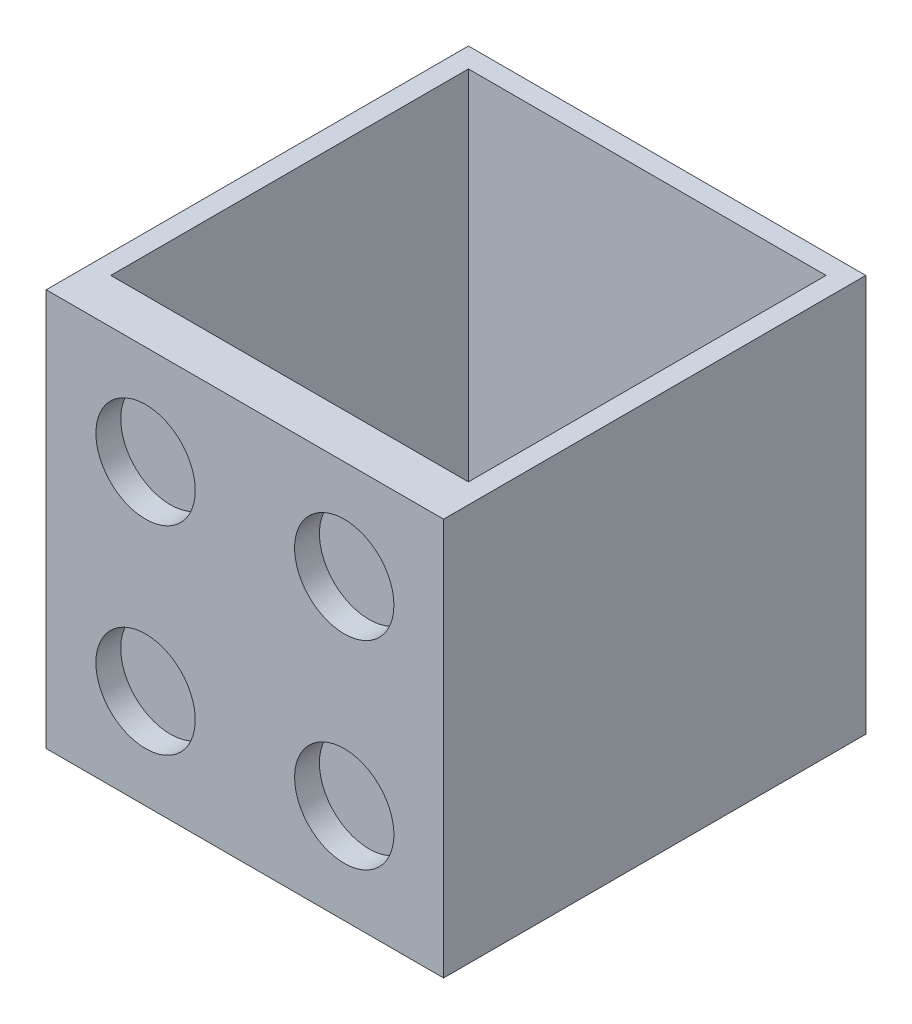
ISO-10303-21;
HEADER;
FILE_DESCRIPTION(('STEP AP214'),'2;1');
FILE_NAME('part.step','',(''),(''),'','','');
FILE_SCHEMA(('AUTOMOTIVE_DESIGN { 1 0 10303 214 1 1 1 1 }'));
ENDSEC;
DATA;
#1=APPLICATION_CONTEXT('core data for automotive mechanical design processes');
#2=APPLICATION_PROTOCOL_DEFINITION('international standard','automotive_design',2000,#1);
#3=PRODUCT_CONTEXT('',#1,'mechanical');
#4=PRODUCT('Part','Part','',(#3));
#5=PRODUCT_RELATED_PRODUCT_CATEGORY('part','',(#4));
#6=PRODUCT_DEFINITION_FORMATION('','',#4);
#7=PRODUCT_DEFINITION_CONTEXT('part definition',#1,'design');
#8=PRODUCT_DEFINITION('design','',#6,#7);
#9=PRODUCT_DEFINITION_SHAPE('','',#8);
#10=(LENGTH_UNIT() NAMED_UNIT(*) SI_UNIT(.MILLI.,.METRE.));
#11=(NAMED_UNIT(*) PLANE_ANGLE_UNIT() SI_UNIT($,.RADIAN.));
#12=(NAMED_UNIT(*) SI_UNIT($,.STERADIAN.) SOLID_ANGLE_UNIT());
#13=UNCERTAINTY_MEASURE_WITH_UNIT(LENGTH_MEASURE(1.E-05),#10,'distance_accuracy_value','');
#14=(GEOMETRIC_REPRESENTATION_CONTEXT(3) GLOBAL_UNCERTAINTY_ASSIGNED_CONTEXT((#13)) GLOBAL_UNIT_ASSIGNED_CONTEXT((#10,
#11,#12)) REPRESENTATION_CONTEXT('',''));
#15=CARTESIAN_POINT('',(0.,0.,0.));
#16=DIRECTION('',(0.,0.,1.));
#17=DIRECTION('',(1.,0.,0.));
#18=AXIS2_PLACEMENT_3D('',#15,#16,#17);
#19=CARTESIAN_POINT('',(0.,0.,53.975));
#20=DIRECTION('',(0.,0.,-1.));
#21=DIRECTION('',(-1.,0.,0.));
#22=AXIS2_PLACEMENT_3D('',#19,#20,#21);
#23=PLANE('',#22);
#24=CARTESIAN_POINT('',(38.1,38.1,53.975));
#25=DIRECTION('',(0.,0.,1.));
#26=DIRECTION('',(1.,0.,0.));
#27=AXIS2_PLACEMENT_3D('',#24,#25,#26);
#28=CIRCLE('',#27,6.35);
#29=CARTESIAN_POINT('',(44.45,38.1,53.975));
#30=VERTEX_POINT('',#29);
#31=EDGE_CURVE('E187',#30,#30,#28,.T.);
#32=ORIENTED_EDGE('',*,*,#31,.F.);
#33=EDGE_LOOP('',(#32));
#34=FACE_BOUND('',#33,.T.);
#35=CARTESIAN_POINT('',(12.7,12.7,53.975));
#36=DIRECTION('',(0.,0.,-1.));
#37=DIRECTION('',(-1.,0.,0.));
#38=AXIS2_PLACEMENT_3D('',#35,#36,#37);
#39=CIRCLE('',#38,6.35);
#40=CARTESIAN_POINT('',(6.35,12.7,53.975));
#41=VERTEX_POINT('',#40);
#42=EDGE_CURVE('E179',#41,#41,#39,.T.);
#43=ORIENTED_EDGE('',*,*,#42,.T.);
#44=EDGE_LOOP('',(#43));
#45=FACE_BOUND('',#44,.T.);
#46=DIRECTION('',(0.,-1.,0.));
#47=VECTOR('',#46,1.);
#48=CARTESIAN_POINT('',(0.,0.,53.975));
#49=LINE('',#48,#47);
#50=CARTESIAN_POINT('',(0.,50.8,53.975));
#51=VERTEX_POINT('',#50);
#52=CARTESIAN_POINT('',(0.,0.,53.975));
#53=VERTEX_POINT('',#52);
#54=EDGE_CURVE('E203',#51,#53,#49,.T.);
#55=ORIENTED_EDGE('',*,*,#54,.T.);
#56=DIRECTION('',(1.,0.,0.));
#57=VECTOR('',#56,1.);
#58=CARTESIAN_POINT('',(0.,0.,53.975));
#59=LINE('',#58,#57);
#60=CARTESIAN_POINT('',(50.8,0.,53.975));
#61=VERTEX_POINT('',#60);
#62=EDGE_CURVE('E98',#53,#61,#59,.T.);
#63=ORIENTED_EDGE('',*,*,#62,.T.);
#64=DIRECTION('',(0.,1.,0.));
#65=VECTOR('',#64,1.);
#66=CARTESIAN_POINT('',(50.8,0.,53.975));
#67=LINE('',#66,#65);
#68=CARTESIAN_POINT('',(50.8,50.8,53.975));
#69=VERTEX_POINT('',#68);
#70=EDGE_CURVE('E208',#61,#69,#67,.T.);
#71=ORIENTED_EDGE('',*,*,#70,.T.);
#72=DIRECTION('',(-1.,0.,0.));
#73=VECTOR('',#72,1.);
#74=CARTESIAN_POINT('',(0.,50.8,53.975));
#75=LINE('',#74,#73);
#76=EDGE_CURVE('E70',#69,#51,#75,.T.);
#77=ORIENTED_EDGE('',*,*,#76,.T.);
#78=EDGE_LOOP('',(#55,#63,#71,#77));
#79=FACE_BOUND('',#78,.T.);
#80=CARTESIAN_POINT('',(38.1,12.7,53.975));
#81=DIRECTION('',(0.,0.,-1.));
#82=DIRECTION('',(-1.,0.,0.));
#83=AXIS2_PLACEMENT_3D('',#80,#81,#82);
#84=CIRCLE('',#83,6.35);
#85=CARTESIAN_POINT('',(31.75,12.7,53.975));
#86=VERTEX_POINT('',#85);
#87=EDGE_CURVE('E171',#86,#86,#84,.T.);
#88=ORIENTED_EDGE('',*,*,#87,.T.);
#89=EDGE_LOOP('',(#88));
#90=FACE_BOUND('',#89,.T.);
#91=CARTESIAN_POINT('',(12.7,38.1,53.975));
#92=DIRECTION('',(0.,0.,1.));
#93=DIRECTION('',(1.,0.,0.));
#94=AXIS2_PLACEMENT_3D('',#91,#92,#93);
#95=CIRCLE('',#94,6.35);
#96=CARTESIAN_POINT('',(19.05,38.1,53.975));
#97=VERTEX_POINT('',#96);
#98=EDGE_CURVE('E195',#97,#97,#95,.T.);
#99=ORIENTED_EDGE('',*,*,#98,.F.);
#100=EDGE_LOOP('',(#99));
#101=FACE_BOUND('',#100,.T.);
#102=ADVANCED_FACE('F45',(#34,#45,#79,#90,#101),#23,.F.);
#103=CARTESIAN_POINT('',(0.,0.,53.975));
#104=DIRECTION('',(1.,0.,0.));
#105=DIRECTION('',(0.,0.,-1.));
#106=AXIS2_PLACEMENT_3D('',#103,#104,#105);
#107=PLANE('',#106);
#108=DIRECTION('',(0.,-1.,0.));
#109=VECTOR('',#108,1.);
#110=CARTESIAN_POINT('',(0.,0.,0.));
#111=LINE('',#110,#109);
#112=CARTESIAN_POINT('',(0.,50.8,0.));
#113=VERTEX_POINT('',#112);
#114=CARTESIAN_POINT('',(0.,0.,0.));
#115=VERTEX_POINT('',#114);
#116=EDGE_CURVE('E199',#113,#115,#111,.T.);
#117=ORIENTED_EDGE('',*,*,#116,.T.);
#118=DIRECTION('',(0.,0.,-1.));
#119=VECTOR('',#118,1.);
#120=CARTESIAN_POINT('',(0.,0.,53.975));
#121=LINE('',#120,#119);
#122=EDGE_CURVE('E11',#53,#115,#121,.T.);
#123=ORIENTED_EDGE('',*,*,#122,.F.);
#124=ORIENTED_EDGE('',*,*,#54,.F.);
#125=DIRECTION('',(0.,0.,-1.));
#126=VECTOR('',#125,1.);
#127=CARTESIAN_POINT('',(0.,50.8,53.975));
#128=LINE('',#127,#126);
#129=EDGE_CURVE('E213',#51,#113,#128,.T.);
#130=ORIENTED_EDGE('',*,*,#129,.T.);
#131=EDGE_LOOP('',(#117,#123,#124,#130));
#132=FACE_BOUND('',#131,.T.);
#133=ADVANCED_FACE('F47',(#132),#107,.F.);
#134=CARTESIAN_POINT('',(0.,0.,53.975));
#135=DIRECTION('',(0.,1.,0.));
#136=DIRECTION('',(0.,0.,1.));
#137=AXIS2_PLACEMENT_3D('',#134,#135,#136);
#138=PLANE('',#137);
#139=DIRECTION('',(1.,0.,0.));
#140=VECTOR('',#139,1.);
#141=CARTESIAN_POINT('',(0.,0.,0.));
#142=LINE('',#141,#140);
#143=CARTESIAN_POINT('',(50.8,0.,0.));
#144=VERTEX_POINT('',#143);
#145=EDGE_CURVE('E217',#115,#144,#142,.T.);
#146=ORIENTED_EDGE('',*,*,#145,.T.);
#147=DIRECTION('',(0.,0.,-1.));
#148=VECTOR('',#147,1.);
#149=CARTESIAN_POINT('',(50.8,0.,53.975));
#150=LINE('',#149,#148);
#151=EDGE_CURVE('E54',#61,#144,#150,.T.);
#152=ORIENTED_EDGE('',*,*,#151,.F.);
#153=ORIENTED_EDGE('',*,*,#62,.F.);
#154=ORIENTED_EDGE('',*,*,#122,.T.);
#155=EDGE_LOOP('',(#146,#152,#153,#154));
#156=FACE_BOUND('',#155,.T.);
#157=ADVANCED_FACE('F254',(#156),#138,.F.);
#158=CARTESIAN_POINT('',(50.8,0.,53.975));
#159=DIRECTION('',(-1.,0.,0.));
#160=DIRECTION('',(0.,0.,1.));
#161=AXIS2_PLACEMENT_3D('',#158,#159,#160);
#162=PLANE('',#161);
#163=DIRECTION('',(0.,1.,0.));
#164=VECTOR('',#163,1.);
#165=CARTESIAN_POINT('',(50.8,0.,0.));
#166=LINE('',#165,#164);
#167=CARTESIAN_POINT('',(50.8,50.8,0.));
#168=VERTEX_POINT('',#167);
#169=EDGE_CURVE('E220',#144,#168,#166,.T.);
#170=ORIENTED_EDGE('',*,*,#169,.T.);
#171=DIRECTION('',(0.,0.,-1.));
#172=VECTOR('',#171,1.);
#173=CARTESIAN_POINT('',(50.8,50.8,53.975));
#174=LINE('',#173,#172);
#175=EDGE_CURVE('E227',#69,#168,#174,.T.);
#176=ORIENTED_EDGE('',*,*,#175,.F.);
#177=ORIENTED_EDGE('',*,*,#70,.F.);
#178=ORIENTED_EDGE('',*,*,#151,.T.);
#179=EDGE_LOOP('',(#170,#176,#177,#178));
#180=FACE_BOUND('',#179,.T.);
#181=ADVANCED_FACE('F234',(#180),#162,.F.);
#182=CARTESIAN_POINT('',(0.,50.8,53.975));
#183=DIRECTION('',(0.,-1.,0.));
#184=DIRECTION('',(0.,0.,-1.));
#185=AXIS2_PLACEMENT_3D('',#182,#183,#184);
#186=PLANE('',#185);
#187=DIRECTION('',(0.,0.,1.));
#188=VECTOR('',#187,1.);
#189=CARTESIAN_POINT('',(2.54,50.8,2.54000000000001));
#190=LINE('',#189,#188);
#191=CARTESIAN_POINT('',(2.54,50.8,2.54000000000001));
#192=VERTEX_POINT('',#191);
#193=CARTESIAN_POINT('',(2.54000000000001,50.8,48.26));
#194=VERTEX_POINT('',#193);
#195=EDGE_CURVE('E156',#192,#194,#190,.T.);
#196=ORIENTED_EDGE('',*,*,#195,.F.);
#197=DIRECTION('',(-1.,0.,0.));
#198=VECTOR('',#197,1.);
#199=CARTESIAN_POINT('',(48.26,50.8,2.54));
#200=LINE('',#199,#198);
#201=CARTESIAN_POINT('',(48.26,50.8,2.54));
#202=VERTEX_POINT('',#201);
#203=EDGE_CURVE('E61',#202,#192,#200,.T.);
#204=ORIENTED_EDGE('',*,*,#203,.F.);
#205=DIRECTION('',(0.,0.,-1.));
#206=VECTOR('',#205,1.);
#207=CARTESIAN_POINT('',(48.26,50.8,48.26));
#208=LINE('',#207,#206);
#209=CARTESIAN_POINT('',(48.26,50.8,48.26));
#210=VERTEX_POINT('',#209);
#211=EDGE_CURVE('E143',#210,#202,#208,.T.);
#212=ORIENTED_EDGE('',*,*,#211,.F.);
#213=DIRECTION('',(1.,0.,0.));
#214=VECTOR('',#213,1.);
#215=CARTESIAN_POINT('',(2.54000000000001,50.8,48.26));
#216=LINE('',#215,#214);
#217=EDGE_CURVE('E147',#194,#210,#216,.T.);
#218=ORIENTED_EDGE('',*,*,#217,.F.);
#219=EDGE_LOOP('',(#196,#204,#212,#218));
#220=FACE_BOUND('',#219,.T.);
#221=DIRECTION('',(-1.,0.,0.));
#222=VECTOR('',#221,1.);
#223=CARTESIAN_POINT('',(0.,50.8,0.));
#224=LINE('',#223,#222);
#225=EDGE_CURVE('E91',#168,#113,#224,.T.);
#226=ORIENTED_EDGE('',*,*,#225,.T.);
#227=ORIENTED_EDGE('',*,*,#129,.F.);
#228=ORIENTED_EDGE('',*,*,#76,.F.);
#229=ORIENTED_EDGE('',*,*,#175,.T.);
#230=EDGE_LOOP('',(#226,#227,#228,#229));
#231=FACE_BOUND('',#230,.T.);
#232=ADVANCED_FACE('F242',(#220,#231),#186,.F.);
#233=CARTESIAN_POINT('',(0.,0.,0.));
#234=DIRECTION('',(0.,0.,-1.));
#235=DIRECTION('',(-1.,0.,0.));
#236=AXIS2_PLACEMENT_3D('',#233,#234,#235);
#237=PLANE('',#236);
#238=ORIENTED_EDGE('',*,*,#116,.F.);
#239=ORIENTED_EDGE('',*,*,#225,.F.);
#240=ORIENTED_EDGE('',*,*,#169,.F.);
#241=ORIENTED_EDGE('',*,*,#145,.F.);
#242=EDGE_LOOP('',(#238,#239,#240,#241));
#243=FACE_BOUND('',#242,.T.);
#244=ADVANCED_FACE('F238',(#243),#237,.T.);
#245=CARTESIAN_POINT('',(12.7,12.7,50.8));
#246=DIRECTION('',(0.,0.,1.));
#247=DIRECTION('',(1.,0.,0.));
#248=AXIS2_PLACEMENT_3D('',#245,#246,#247);
#249=CYLINDRICAL_SURFACE('',#248,6.35);
#250=CARTESIAN_POINT('',(12.7,12.7,50.8));
#251=DIRECTION('',(0.,0.,-1.));
#252=DIRECTION('',(-1.,0.,0.));
#253=AXIS2_PLACEMENT_3D('',#250,#251,#252);
#254=CIRCLE('',#253,6.35);
#255=CARTESIAN_POINT('',(6.35,12.7,50.8));
#256=VERTEX_POINT('',#255);
#257=EDGE_CURVE('E175',#256,#256,#254,.T.);
#258=ORIENTED_EDGE('',*,*,#257,.T.);
#259=EDGE_LOOP('',(#258));
#260=FACE_BOUND('',#259,.T.);
#261=ORIENTED_EDGE('',*,*,#42,.F.);
#262=EDGE_LOOP('',(#261));
#263=FACE_BOUND('',#262,.T.);
#264=ADVANCED_FACE('F251',(#260,#263),#249,.F.);
#265=CARTESIAN_POINT('',(12.7,12.7,50.8));
#266=DIRECTION('',(0.,0.,-1.));
#267=DIRECTION('',(-1.,0.,0.));
#268=AXIS2_PLACEMENT_3D('',#265,#266,#267);
#269=PLANE('',#268);
#270=ORIENTED_EDGE('',*,*,#257,.F.);
#271=EDGE_LOOP('',(#270));
#272=FACE_BOUND('',#271,.T.);
#273=ADVANCED_FACE('F282',(#272),#269,.F.);
#274=CARTESIAN_POINT('',(38.1,38.1,50.8));
#275=DIRECTION('',(0.,0.,1.));
#276=DIRECTION('',(1.,0.,0.));
#277=AXIS2_PLACEMENT_3D('',#274,#275,#276);
#278=CYLINDRICAL_SURFACE('',#277,6.35);
#279=CARTESIAN_POINT('',(38.1,38.1,50.8));
#280=DIRECTION('',(0.,0.,1.));
#281=DIRECTION('',(1.,0.,0.));
#282=AXIS2_PLACEMENT_3D('',#279,#280,#281);
#283=CIRCLE('',#282,6.35);
#284=CARTESIAN_POINT('',(44.45,38.1,50.8));
#285=VERTEX_POINT('',#284);
#286=EDGE_CURVE('E183',#285,#285,#283,.T.);
#287=ORIENTED_EDGE('',*,*,#286,.F.);
#288=EDGE_LOOP('',(#287));
#289=FACE_BOUND('',#288,.T.);
#290=ORIENTED_EDGE('',*,*,#31,.T.);
#291=EDGE_LOOP('',(#290));
#292=FACE_BOUND('',#291,.T.);
#293=ADVANCED_FACE('F278',(#289,#292),#278,.F.);
#294=CARTESIAN_POINT('',(38.1,38.1,50.8));
#295=DIRECTION('',(0.,0.,1.));
#296=DIRECTION('',(1.,0.,0.));
#297=AXIS2_PLACEMENT_3D('',#294,#295,#296);
#298=PLANE('',#297);
#299=ORIENTED_EDGE('',*,*,#286,.T.);
#300=EDGE_LOOP('',(#299));
#301=FACE_BOUND('',#300,.T.);
#302=ADVANCED_FACE('F274',(#301),#298,.T.);
#303=CARTESIAN_POINT('',(38.1,12.7,50.8));
#304=DIRECTION('',(0.,0.,1.));
#305=DIRECTION('',(1.,0.,0.));
#306=AXIS2_PLACEMENT_3D('',#303,#304,#305);
#307=CYLINDRICAL_SURFACE('',#306,6.35);
#308=CARTESIAN_POINT('',(38.1,12.7,50.8));
#309=DIRECTION('',(0.,0.,-1.));
#310=DIRECTION('',(-1.,0.,0.));
#311=AXIS2_PLACEMENT_3D('',#308,#309,#310);
#312=CIRCLE('',#311,6.35);
#313=CARTESIAN_POINT('',(31.75,12.7,50.8));
#314=VERTEX_POINT('',#313);
#315=EDGE_CURVE('E165',#314,#314,#312,.T.);
#316=ORIENTED_EDGE('',*,*,#315,.T.);
#317=EDGE_LOOP('',(#316));
#318=FACE_BOUND('',#317,.T.);
#319=ORIENTED_EDGE('',*,*,#87,.F.);
#320=EDGE_LOOP('',(#319));
#321=FACE_BOUND('',#320,.T.);
#322=ADVANCED_FACE('F277',(#318,#321),#307,.F.);
#323=CARTESIAN_POINT('',(38.1,12.7,50.8));
#324=DIRECTION('',(0.,0.,-1.));
#325=DIRECTION('',(-1.,0.,0.));
#326=AXIS2_PLACEMENT_3D('',#323,#324,#325);
#327=PLANE('',#326);
#328=ORIENTED_EDGE('',*,*,#315,.F.);
#329=EDGE_LOOP('',(#328));
#330=FACE_BOUND('',#329,.T.);
#331=ADVANCED_FACE('F272',(#330),#327,.F.);
#332=CARTESIAN_POINT('',(12.7,38.1,50.8));
#333=DIRECTION('',(0.,0.,1.));
#334=DIRECTION('',(1.,0.,0.));
#335=AXIS2_PLACEMENT_3D('',#332,#333,#334);
#336=CYLINDRICAL_SURFACE('',#335,6.35);
#337=CARTESIAN_POINT('',(12.7,38.1,50.8));
#338=DIRECTION('',(0.,0.,1.));
#339=DIRECTION('',(1.,0.,0.));
#340=AXIS2_PLACEMENT_3D('',#337,#338,#339);
#341=CIRCLE('',#340,6.35);
#342=CARTESIAN_POINT('',(19.05,38.1,50.8));
#343=VERTEX_POINT('',#342);
#344=EDGE_CURVE('E191',#343,#343,#341,.T.);
#345=ORIENTED_EDGE('',*,*,#344,.F.);
#346=EDGE_LOOP('',(#345));
#347=FACE_BOUND('',#346,.T.);
#348=ORIENTED_EDGE('',*,*,#98,.T.);
#349=EDGE_LOOP('',(#348));
#350=FACE_BOUND('',#349,.T.);
#351=ADVANCED_FACE('F268',(#347,#350),#336,.F.);
#352=CARTESIAN_POINT('',(12.7,38.1,50.8));
#353=DIRECTION('',(0.,0.,1.));
#354=DIRECTION('',(1.,0.,0.));
#355=AXIS2_PLACEMENT_3D('',#352,#353,#354);
#356=PLANE('',#355);
#357=ORIENTED_EDGE('',*,*,#344,.T.);
#358=EDGE_LOOP('',(#357));
#359=FACE_BOUND('',#358,.T.);
#360=ADVANCED_FACE('F266',(#359),#356,.T.);
#361=CARTESIAN_POINT('',(48.26,2.54,2.54));
#362=DIRECTION('',(0.,0.,-1.));
#363=DIRECTION('',(-1.,0.,0.));
#364=AXIS2_PLACEMENT_3D('',#361,#362,#363);
#365=PLANE('',#364);
#366=ORIENTED_EDGE('',*,*,#203,.T.);
#367=DIRECTION('',(0.,1.,0.));
#368=VECTOR('',#367,1.);
#369=CARTESIAN_POINT('',(2.54,2.54,2.54000000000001));
#370=LINE('',#369,#368);
#371=CARTESIAN_POINT('',(2.54,2.54,2.54000000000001));
#372=VERTEX_POINT('',#371);
#373=EDGE_CURVE('E118',#372,#192,#370,.T.);
#374=ORIENTED_EDGE('',*,*,#373,.F.);
#375=DIRECTION('',(-1.,0.,0.));
#376=VECTOR('',#375,1.);
#377=CARTESIAN_POINT('',(48.26,2.54,2.54));
#378=LINE('',#377,#376);
#379=CARTESIAN_POINT('',(48.26,2.54,2.54));
#380=VERTEX_POINT('',#379);
#381=EDGE_CURVE('E122',#380,#372,#378,.T.);
#382=ORIENTED_EDGE('',*,*,#381,.F.);
#383=DIRECTION('',(0.,1.,0.));
#384=VECTOR('',#383,1.);
#385=CARTESIAN_POINT('',(48.26,2.54,2.54));
#386=LINE('',#385,#384);
#387=EDGE_CURVE('E162',#380,#202,#386,.T.);
#388=ORIENTED_EDGE('',*,*,#387,.T.);
#389=EDGE_LOOP('',(#366,#374,#382,#388));
#390=FACE_BOUND('',#389,.T.);
#391=ADVANCED_FACE('F120',(#390),#365,.F.);
#392=CARTESIAN_POINT('',(48.26,2.54,48.26));
#393=DIRECTION('',(1.,0.,0.));
#394=DIRECTION('',(0.,0.,-1.));
#395=AXIS2_PLACEMENT_3D('',#392,#393,#394);
#396=PLANE('',#395);
#397=ORIENTED_EDGE('',*,*,#211,.T.);
#398=ORIENTED_EDGE('',*,*,#387,.F.);
#399=DIRECTION('',(0.,0.,-1.));
#400=VECTOR('',#399,1.);
#401=CARTESIAN_POINT('',(48.26,2.54,48.26));
#402=LINE('',#401,#400);
#403=CARTESIAN_POINT('',(48.26,2.54,48.26));
#404=VERTEX_POINT('',#403);
#405=EDGE_CURVE('E129',#404,#380,#402,.T.);
#406=ORIENTED_EDGE('',*,*,#405,.F.);
#407=DIRECTION('',(0.,1.,0.));
#408=VECTOR('',#407,1.);
#409=CARTESIAN_POINT('',(48.26,2.54,48.26));
#410=LINE('',#409,#408);
#411=EDGE_CURVE('E166',#404,#210,#410,.T.);
#412=ORIENTED_EDGE('',*,*,#411,.T.);
#413=EDGE_LOOP('',(#397,#398,#406,#412));
#414=FACE_BOUND('',#413,.T.);
#415=ADVANCED_FACE('F296',(#414),#396,.F.);
#416=CARTESIAN_POINT('',(2.54000000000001,2.54,48.26));
#417=DIRECTION('',(0.,0.,1.));
#418=DIRECTION('',(1.,0.,0.));
#419=AXIS2_PLACEMENT_3D('',#416,#417,#418);
#420=PLANE('',#419);
#421=ORIENTED_EDGE('',*,*,#217,.T.);
#422=ORIENTED_EDGE('',*,*,#411,.F.);
#423=DIRECTION('',(1.,0.,0.));
#424=VECTOR('',#423,1.);
#425=CARTESIAN_POINT('',(2.54000000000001,2.54,48.26));
#426=LINE('',#425,#424);
#427=CARTESIAN_POINT('',(2.54000000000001,2.54,48.26));
#428=VERTEX_POINT('',#427);
#429=EDGE_CURVE('E138',#428,#404,#426,.T.);
#430=ORIENTED_EDGE('',*,*,#429,.F.);
#431=DIRECTION('',(0.,1.,0.));
#432=VECTOR('',#431,1.);
#433=CARTESIAN_POINT('',(2.54000000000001,2.54,48.26));
#434=LINE('',#433,#432);
#435=EDGE_CURVE('E128',#428,#194,#434,.T.);
#436=ORIENTED_EDGE('',*,*,#435,.T.);
#437=EDGE_LOOP('',(#421,#422,#430,#436));
#438=FACE_BOUND('',#437,.T.);
#439=ADVANCED_FACE('F299',(#438),#420,.F.);
#440=CARTESIAN_POINT('',(2.54,2.54,2.54000000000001));
#441=DIRECTION('',(-1.,0.,0.));
#442=DIRECTION('',(0.,0.,1.));
#443=AXIS2_PLACEMENT_3D('',#440,#441,#442);
#444=PLANE('',#443);
#445=ORIENTED_EDGE('',*,*,#195,.T.);
#446=ORIENTED_EDGE('',*,*,#435,.F.);
#447=DIRECTION('',(0.,0.,1.));
#448=VECTOR('',#447,1.);
#449=CARTESIAN_POINT('',(2.54,2.54,2.54000000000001));
#450=LINE('',#449,#448);
#451=EDGE_CURVE('E132',#372,#428,#450,.T.);
#452=ORIENTED_EDGE('',*,*,#451,.F.);
#453=ORIENTED_EDGE('',*,*,#373,.T.);
#454=EDGE_LOOP('',(#445,#446,#452,#453));
#455=FACE_BOUND('',#454,.T.);
#456=ADVANCED_FACE('F133',(#455),#444,.F.);
#457=CARTESIAN_POINT('',(0.,2.54,0.));
#458=DIRECTION('',(0.,1.,0.));
#459=DIRECTION('',(0.,0.,1.));
#460=AXIS2_PLACEMENT_3D('',#457,#458,#459);
#461=PLANE('',#460);
#462=ORIENTED_EDGE('',*,*,#381,.T.);
#463=ORIENTED_EDGE('',*,*,#451,.T.);
#464=ORIENTED_EDGE('',*,*,#429,.T.);
#465=ORIENTED_EDGE('',*,*,#405,.T.);
#466=EDGE_LOOP('',(#462,#463,#464,#465));
#467=FACE_BOUND('',#466,.T.);
#468=ADVANCED_FACE('F140',(#467),#461,.T.);
#469=CLOSED_SHELL('',(#102,#133,#157,#181,#232,#244,#264,#273,#293,#302,#322,#331,#351,#360,
#391,#415,#439,#456,#468));
#470=MANIFOLD_SOLID_BREP('B2',#469);
#471=ADVANCED_BREP_SHAPE_REPRESENTATION('',(#18,#470),#14);
#472=SHAPE_DEFINITION_REPRESENTATION(#9,#471);
ENDSEC;
END-ISO-10303-21;
